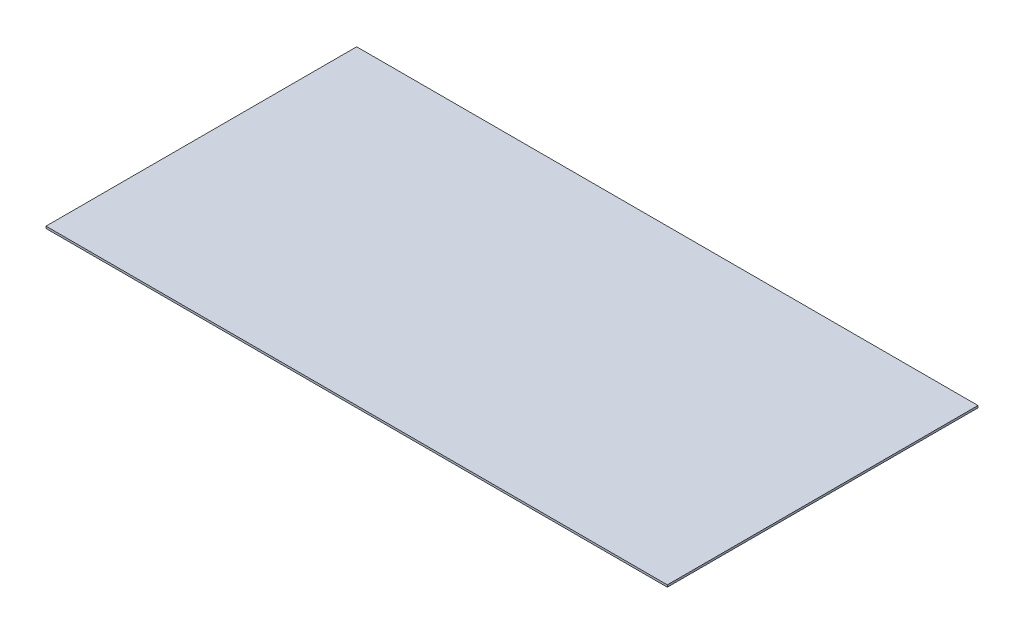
from build123d import *

# Parameters (mm, degrees)
SKETCH1_W           = 3000
SKETCH1_H           = 1500
BOSS_EXTRUDE1_DEPTH = 10


with BuildPart() as part:
    # Sketch1 → Boss-Extrude1 (new body)
    with BuildSketch(Plane(origin=(0, 0, 0), x_dir=(1, 0, 0), z_dir=(0, 1, 0))):
        Rectangle(SKETCH1_W, SKETCH1_H)
    extrude(amount=BOSS_EXTRUDE1_DEPTH)


solid = part.part
